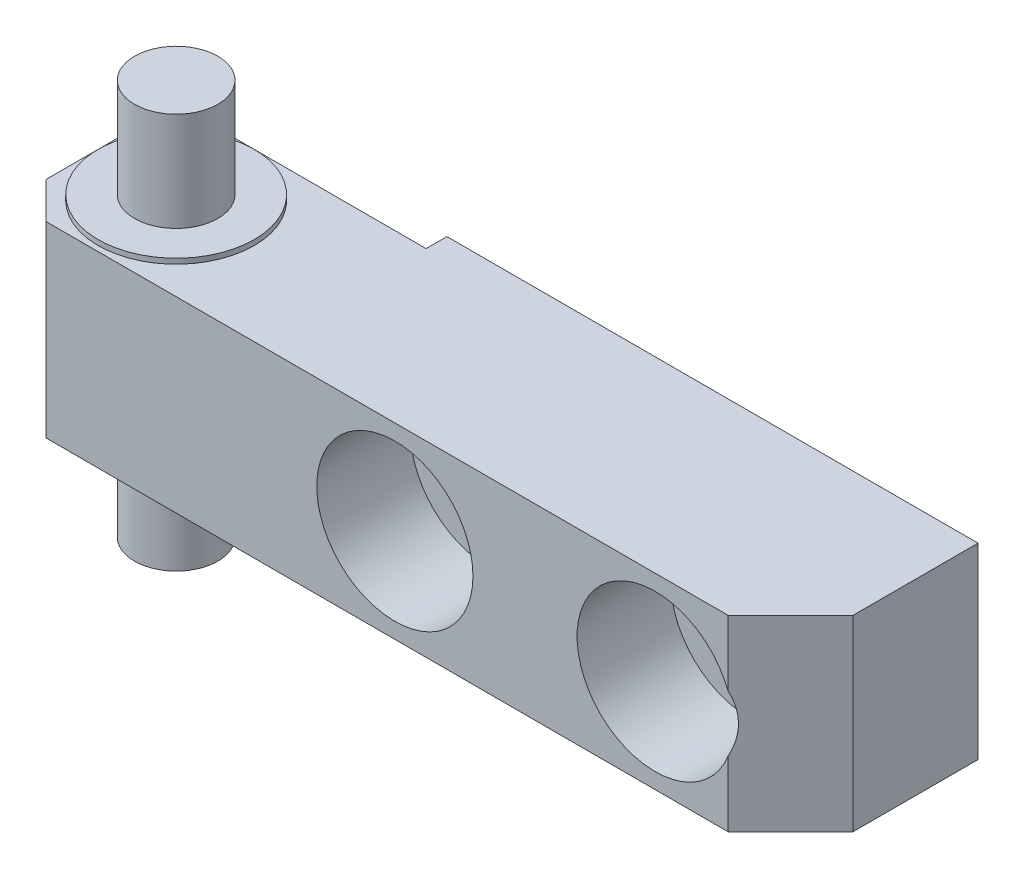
ISO-10303-21;
HEADER;
FILE_DESCRIPTION(('STEP AP214'),'2;1');
FILE_NAME('part.step','',(''),(''),'','','');
FILE_SCHEMA(('AUTOMOTIVE_DESIGN { 1 0 10303 214 1 1 1 1 }'));
ENDSEC;
DATA;
#1=APPLICATION_CONTEXT('core data for automotive mechanical design processes');
#2=APPLICATION_PROTOCOL_DEFINITION('international standard','automotive_design',2000,#1);
#3=PRODUCT_CONTEXT('',#1,'mechanical');
#4=PRODUCT('Part','Part','',(#3));
#5=PRODUCT_RELATED_PRODUCT_CATEGORY('part','',(#4));
#6=PRODUCT_DEFINITION_FORMATION('','',#4);
#7=PRODUCT_DEFINITION_CONTEXT('part definition',#1,'design');
#8=PRODUCT_DEFINITION('design','',#6,#7);
#9=PRODUCT_DEFINITION_SHAPE('','',#8);
#10=(LENGTH_UNIT() NAMED_UNIT(*) SI_UNIT(.MILLI.,.METRE.));
#11=(NAMED_UNIT(*) PLANE_ANGLE_UNIT() SI_UNIT($,.RADIAN.));
#12=(NAMED_UNIT(*) SI_UNIT($,.STERADIAN.) SOLID_ANGLE_UNIT());
#13=UNCERTAINTY_MEASURE_WITH_UNIT(LENGTH_MEASURE(1.E-05),#10,'distance_accuracy_value','');
#14=(GEOMETRIC_REPRESENTATION_CONTEXT(3) GLOBAL_UNCERTAINTY_ASSIGNED_CONTEXT((#13)) GLOBAL_UNIT_ASSIGNED_CONTEXT((#10,
#11,#12)) REPRESENTATION_CONTEXT('',''));
#15=CARTESIAN_POINT('',(0.,0.,0.));
#16=DIRECTION('',(0.,0.,1.));
#17=DIRECTION('',(1.,0.,0.));
#18=AXIS2_PLACEMENT_3D('',#15,#16,#17);
#19=CARTESIAN_POINT('',(-67.,28.,-8.));
#20=DIRECTION('',(0.,-1.,0.));
#21=DIRECTION('',(0.,0.,1.));
#22=AXIS2_PLACEMENT_3D('',#19,#20,#21);
#23=CYLINDRICAL_SURFACE('',#22,4.);
#24=CARTESIAN_POINT('',(-67.,-10.,-8.));
#25=DIRECTION('',(0.,-1.,0.));
#26=DIRECTION('',(0.,0.,1.));
#27=AXIS2_PLACEMENT_3D('',#24,#25,#26);
#28=CIRCLE('',#27,4.);
#29=CARTESIAN_POINT('',(-67.,-10.,-4.));
#30=VERTEX_POINT('',#29);
#31=EDGE_CURVE('E133',#30,#30,#28,.F.);
#32=ORIENTED_EDGE('',*,*,#31,.T.);
#33=EDGE_LOOP('',(#32));
#34=FACE_BOUND('',#33,.T.);
#35=CARTESIAN_POINT('',(-67.,-0.5,-8.));
#36=DIRECTION('',(0.,1.,0.));
#37=DIRECTION('',(0.,0.,1.));
#38=AXIS2_PLACEMENT_3D('',#35,#36,#37);
#39=CIRCLE('',#38,4.);
#40=CARTESIAN_POINT('',(-67.,-0.499999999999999,-4.));
#41=VERTEX_POINT('',#40);
#42=EDGE_CURVE('E130',#41,#41,#39,.T.);
#43=ORIENTED_EDGE('',*,*,#42,.F.);
#44=EDGE_LOOP('',(#43));
#45=FACE_BOUND('',#44,.T.);
#46=ADVANCED_FACE('F14',(#34,#45),#23,.T.);
#47=CARTESIAN_POINT('',(-67.,-10.,-8.));
#48=DIRECTION('',(0.,-1.,0.));
#49=DIRECTION('',(0.,0.,1.));
#50=AXIS2_PLACEMENT_3D('',#47,#48,#49);
#51=PLANE('',#50);
#52=ORIENTED_EDGE('',*,*,#31,.F.);
#53=EDGE_LOOP('',(#52));
#54=FACE_BOUND('',#53,.T.);
#55=ADVANCED_FACE('F16',(#54),#51,.T.);
#56=CARTESIAN_POINT('',(-67.,-0.5,-8.));
#57=DIRECTION('',(0.,1.,0.));
#58=DIRECTION('',(0.,0.,1.));
#59=AXIS2_PLACEMENT_3D('',#56,#57,#58);
#60=PLANE('',#59);
#61=ORIENTED_EDGE('',*,*,#42,.T.);
#62=EDGE_LOOP('',(#61));
#63=FACE_BOUND('',#62,.T.);
#64=CARTESIAN_POINT('',(-67.,-0.5,-8.));
#65=DIRECTION('',(0.,1.,0.));
#66=DIRECTION('',(-1.,0.,0.));
#67=AXIS2_PLACEMENT_3D('',#64,#65,#66);
#68=CIRCLE('',#67,7.5);
#69=CARTESIAN_POINT('',(-74.5,-0.499999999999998,-8.));
#70=VERTEX_POINT('',#69);
#71=EDGE_CURVE('E121',#70,#70,#68,.T.);
#72=ORIENTED_EDGE('',*,*,#71,.F.);
#73=EDGE_LOOP('',(#72));
#74=FACE_BOUND('',#73,.T.);
#75=ADVANCED_FACE('F142',(#63,#74),#60,.F.);
#76=CARTESIAN_POINT('',(-67.,18.5,-8.));
#77=DIRECTION('',(0.,-1.,0.));
#78=DIRECTION('',(1.,0.,0.));
#79=AXIS2_PLACEMENT_3D('',#76,#77,#78);
#80=CYLINDRICAL_SURFACE('',#79,7.5);
#81=CARTESIAN_POINT('',(-67.,18.,-8.));
#82=DIRECTION('',(0.,-1.,0.));
#83=DIRECTION('',(1.,0.,0.));
#84=AXIS2_PLACEMENT_3D('',#81,#82,#83);
#85=CIRCLE('',#84,7.5);
#86=CARTESIAN_POINT('',(-59.5,18.,-8.));
#87=VERTEX_POINT('',#86);
#88=EDGE_CURVE('E124',#87,#87,#85,.F.);
#89=ORIENTED_EDGE('',*,*,#88,.T.);
#90=EDGE_LOOP('',(#89));
#91=FACE_BOUND('',#90,.T.);
#92=CARTESIAN_POINT('',(-67.,18.5,-8.));
#93=DIRECTION('',(0.,-1.,0.));
#94=DIRECTION('',(1.,0.,0.));
#95=AXIS2_PLACEMENT_3D('',#92,#93,#94);
#96=CIRCLE('',#95,7.5);
#97=CARTESIAN_POINT('',(-59.5,18.5,-8.));
#98=VERTEX_POINT('',#97);
#99=EDGE_CURVE('E127',#98,#98,#96,.T.);
#100=ORIENTED_EDGE('',*,*,#99,.T.);
#101=EDGE_LOOP('',(#100));
#102=FACE_BOUND('',#101,.T.);
#103=ADVANCED_FACE('F149',(#91,#102),#80,.T.);
#104=CARTESIAN_POINT('',(0.,0.,-9.));
#105=DIRECTION('',(0.,0.,1.));
#106=DIRECTION('',(1.,0.,0.));
#107=AXIS2_PLACEMENT_3D('',#104,#105,#106);
#108=PLANE('',#107);
#109=CARTESIAN_POINT('',(-13.,9.,-9.));
#110=DIRECTION('',(0.,0.,-1.));
#111=DIRECTION('',(-1.,0.,0.));
#112=AXIS2_PLACEMENT_3D('',#109,#110,#111);
#113=CIRCLE('',#112,4.2);
#114=CARTESIAN_POINT('',(-17.2,9.,-9.));
#115=VERTEX_POINT('',#114);
#116=EDGE_CURVE('E302',#115,#115,#113,.T.);
#117=ORIENTED_EDGE('',*,*,#116,.T.);
#118=EDGE_LOOP('',(#117));
#119=FACE_BOUND('',#118,.T.);
#120=CARTESIAN_POINT('',(-13.,9.,-9.));
#121=DIRECTION('',(0.,0.,1.));
#122=DIRECTION('',(1.,0.,0.));
#123=AXIS2_PLACEMENT_3D('',#120,#121,#122);
#124=CIRCLE('',#123,7.5);
#125=CARTESIAN_POINT('',(-5.5,9.,-9.));
#126=VERTEX_POINT('',#125);
#127=EDGE_CURVE('E379',#126,#126,#124,.T.);
#128=ORIENTED_EDGE('',*,*,#127,.T.);
#129=EDGE_LOOP('',(#128));
#130=FACE_BOUND('',#129,.T.);
#131=ADVANCED_FACE('F176',(#119,#130),#108,.T.);
#132=CARTESIAN_POINT('',(0.,0.,-9.));
#133=DIRECTION('',(0.,0.,1.));
#134=DIRECTION('',(1.,0.,0.));
#135=AXIS2_PLACEMENT_3D('',#132,#133,#134);
#136=PLANE('',#135);
#137=CARTESIAN_POINT('',(-38.,9.,-9.));
#138=DIRECTION('',(0.,0.,1.));
#139=DIRECTION('',(1.,0.,0.));
#140=AXIS2_PLACEMENT_3D('',#137,#138,#139);
#141=CIRCLE('',#140,4.2);
#142=CARTESIAN_POINT('',(-33.8,9.,-9.));
#143=VERTEX_POINT('',#142);
#144=EDGE_CURVE('E376',#143,#143,#141,.F.);
#145=ORIENTED_EDGE('',*,*,#144,.T.);
#146=EDGE_LOOP('',(#145));
#147=FACE_BOUND('',#146,.T.);
#148=CARTESIAN_POINT('',(-38.,9.,-9.));
#149=DIRECTION('',(0.,0.,1.));
#150=DIRECTION('',(1.,0.,0.));
#151=AXIS2_PLACEMENT_3D('',#148,#149,#150);
#152=CIRCLE('',#151,7.5);
#153=CARTESIAN_POINT('',(-30.5,9.,-9.));
#154=VERTEX_POINT('',#153);
#155=EDGE_CURVE('E134',#154,#154,#152,.T.);
#156=ORIENTED_EDGE('',*,*,#155,.T.);
#157=EDGE_LOOP('',(#156));
#158=FACE_BOUND('',#157,.T.);
#159=ADVANCED_FACE('F184',(#147,#158),#136,.T.);
#160=CARTESIAN_POINT('',(-67.,-0.5,-8.));
#161=DIRECTION('',(0.,1.,0.));
#162=DIRECTION('',(-1.,0.,0.));
#163=AXIS2_PLACEMENT_3D('',#160,#161,#162);
#164=CYLINDRICAL_SURFACE('',#163,7.5);
#165=CARTESIAN_POINT('',(-67.,0.,-8.));
#166=DIRECTION('',(0.,1.,0.));
#167=DIRECTION('',(-1.,0.,0.));
#168=AXIS2_PLACEMENT_3D('',#165,#166,#167);
#169=CIRCLE('',#168,7.5);
#170=CARTESIAN_POINT('',(-74.5,0.,-8.));
#171=VERTEX_POINT('',#170);
#172=EDGE_CURVE('E109',#171,#171,#169,.F.);
#173=ORIENTED_EDGE('',*,*,#172,.T.);
#174=EDGE_LOOP('',(#173));
#175=FACE_BOUND('',#174,.T.);
#176=ORIENTED_EDGE('',*,*,#71,.T.);
#177=EDGE_LOOP('',(#176));
#178=FACE_BOUND('',#177,.T.);
#179=ADVANCED_FACE('F179',(#175,#178),#164,.T.);
#180=CARTESIAN_POINT('',(-38.,9.,0.));
#181=DIRECTION('',(0.,0.,1.));
#182=DIRECTION('',(1.,0.,0.));
#183=AXIS2_PLACEMENT_3D('',#180,#181,#182);
#184=CYLINDRICAL_SURFACE('',#183,4.2);
#185=CARTESIAN_POINT('',(-38.,9.,-18.));
#186=DIRECTION('',(0.,0.,1.));
#187=DIRECTION('',(1.,0.,0.));
#188=AXIS2_PLACEMENT_3D('',#185,#186,#187);
#189=CIRCLE('',#188,4.2);
#190=CARTESIAN_POINT('',(-33.8,9.,-18.));
#191=VERTEX_POINT('',#190);
#192=EDGE_CURVE('E278',#191,#191,#189,.T.);
#193=ORIENTED_EDGE('',*,*,#192,.F.);
#194=EDGE_LOOP('',(#193));
#195=FACE_BOUND('',#194,.T.);
#196=ORIENTED_EDGE('',*,*,#144,.F.);
#197=EDGE_LOOP('',(#196));
#198=FACE_BOUND('',#197,.T.);
#199=ADVANCED_FACE('F190',(#195,#198),#184,.F.);
#200=CARTESIAN_POINT('',(-13.,9.,-9.));
#201=DIRECTION('',(0.,0.,-1.));
#202=DIRECTION('',(-1.,0.,0.));
#203=AXIS2_PLACEMENT_3D('',#200,#201,#202);
#204=CYLINDRICAL_SURFACE('',#203,4.2);
#205=ORIENTED_EDGE('',*,*,#116,.F.);
#206=EDGE_LOOP('',(#205));
#207=FACE_BOUND('',#206,.T.);
#208=CARTESIAN_POINT('',(-13.,9.,-18.));
#209=DIRECTION('',(0.,0.,-1.));
#210=DIRECTION('',(-1.,0.,0.));
#211=AXIS2_PLACEMENT_3D('',#208,#209,#210);
#212=CIRCLE('',#211,4.2);
#213=CARTESIAN_POINT('',(-17.2,9.,-18.));
#214=VERTEX_POINT('',#213);
#215=EDGE_CURVE('E282',#214,#214,#212,.F.);
#216=ORIENTED_EDGE('',*,*,#215,.F.);
#217=EDGE_LOOP('',(#216));
#218=FACE_BOUND('',#217,.T.);
#219=ADVANCED_FACE('F197',(#207,#218),#204,.F.);
#220=CARTESIAN_POINT('',(-13.,9.,0.));
#221=DIRECTION('',(0.,0.,1.));
#222=DIRECTION('',(1.,0.,0.));
#223=AXIS2_PLACEMENT_3D('',#220,#221,#222);
#224=CYLINDRICAL_SURFACE('',#223,7.5);
#225=ORIENTED_EDGE('',*,*,#127,.F.);
#226=EDGE_LOOP('',(#225));
#227=FACE_BOUND('',#226,.T.);
#228=CARTESIAN_POINT('',(-13.,9.,0.));
#229=DIRECTION('',(0.,0.,1.));
#230=DIRECTION('',(1.,0.,0.));
#231=AXIS2_PLACEMENT_3D('',#228,#229,#230);
#232=CIRCLE('',#231,7.5);
#233=CARTESIAN_POINT('',(-6.,11.6925824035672,0.));
#234=VERTEX_POINT('',#233);
#235=CARTESIAN_POINT('',(-6.,6.30741759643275,0.));
#236=VERTEX_POINT('',#235);
#237=EDGE_CURVE('E271',#234,#236,#232,.T.);
#238=ORIENTED_EDGE('',*,*,#237,.T.);
#239=CARTESIAN_POINT('',(-13.,9.,7.));
#240=DIRECTION('',(0.707106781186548,0.,0.707106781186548));
#241=DIRECTION('',(-0.707106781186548,0.,0.707106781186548));
#242=AXIS2_PLACEMENT_3D('',#239,#240,#241);
#243=ELLIPSE('',#242,10.6066017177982,7.5);
#244=EDGE_CURVE('E273',#234,#236,#243,.F.);
#245=ORIENTED_EDGE('',*,*,#244,.F.);
#246=EDGE_LOOP('',(#238,#245));
#247=FACE_BOUND('',#246,.T.);
#248=ADVANCED_FACE('F200',(#227,#247),#224,.F.);
#249=CARTESIAN_POINT('',(-38.,9.,0.));
#250=DIRECTION('',(0.,0.,1.));
#251=DIRECTION('',(1.,0.,0.));
#252=AXIS2_PLACEMENT_3D('',#249,#250,#251);
#253=CYLINDRICAL_SURFACE('',#252,7.5);
#254=ORIENTED_EDGE('',*,*,#155,.F.);
#255=EDGE_LOOP('',(#254));
#256=FACE_BOUND('',#255,.T.);
#257=CARTESIAN_POINT('',(-38.,9.,0.));
#258=DIRECTION('',(0.,0.,1.));
#259=DIRECTION('',(1.,0.,0.));
#260=AXIS2_PLACEMENT_3D('',#257,#258,#259);
#261=CIRCLE('',#260,7.5);
#262=CARTESIAN_POINT('',(-30.5,9.,0.));
#263=VERTEX_POINT('',#262);
#264=EDGE_CURVE('E260',#263,#263,#261,.T.);
#265=ORIENTED_EDGE('',*,*,#264,.T.);
#266=EDGE_LOOP('',(#265));
#267=FACE_BOUND('',#266,.T.);
#268=ADVANCED_FACE('F187',(#256,#267),#253,.F.);
#269=CARTESIAN_POINT('',(0.,0.,0.));
#270=DIRECTION('',(0.,-1.,0.));
#271=DIRECTION('',(0.,0.,1.));
#272=AXIS2_PLACEMENT_3D('',#269,#270,#271);
#273=PLANE('',#272);
#274=ORIENTED_EDGE('',*,*,#172,.F.);
#275=EDGE_LOOP('',(#274));
#276=FACE_BOUND('',#275,.T.);
#277=DIRECTION('',(-0.707106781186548,0.,0.707106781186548));
#278=VECTOR('',#277,1.);
#279=CARTESIAN_POINT('',(-75.,0.,-12.5));
#280=LINE('',#279,#278);
#281=CARTESIAN_POINT('',(-71.5,0.,-16.));
#282=VERTEX_POINT('',#281);
#283=CARTESIAN_POINT('',(-75.,0.,-12.5));
#284=VERTEX_POINT('',#283);
#285=EDGE_CURVE('E300',#282,#284,#280,.T.);
#286=ORIENTED_EDGE('',*,*,#285,.F.);
#287=DIRECTION('',(1.,0.,0.));
#288=VECTOR('',#287,1.);
#289=CARTESIAN_POINT('',(-75.,0.,-16.));
#290=LINE('',#289,#288);
#291=CARTESIAN_POINT('',(-51.,0.,-16.));
#292=VERTEX_POINT('',#291);
#293=EDGE_CURVE('E99',#282,#292,#290,.T.);
#294=ORIENTED_EDGE('',*,*,#293,.T.);
#295=DIRECTION('',(0.,0.,-1.));
#296=VECTOR('',#295,1.);
#297=CARTESIAN_POINT('',(-51.,0.,-16.));
#298=LINE('',#297,#296);
#299=CARTESIAN_POINT('',(-51.,0.,-18.));
#300=VERTEX_POINT('',#299);
#301=EDGE_CURVE('E96',#292,#300,#298,.T.);
#302=ORIENTED_EDGE('',*,*,#301,.T.);
#303=DIRECTION('',(-1.,0.,0.));
#304=VECTOR('',#303,1.);
#305=CARTESIAN_POINT('',(0.,0.,-18.));
#306=LINE('',#305,#304);
#307=CARTESIAN_POINT('',(0.,0.,-18.));
#308=VERTEX_POINT('',#307);
#309=EDGE_CURVE('E281',#308,#300,#306,.T.);
#310=ORIENTED_EDGE('',*,*,#309,.F.);
#311=DIRECTION('',(0.,0.,-1.));
#312=VECTOR('',#311,1.);
#313=CARTESIAN_POINT('',(0.,0.,0.));
#314=LINE('',#313,#312);
#315=CARTESIAN_POINT('',(0.,0.,-6.));
#316=VERTEX_POINT('',#315);
#317=EDGE_CURVE('E277',#316,#308,#314,.T.);
#318=ORIENTED_EDGE('',*,*,#317,.F.);
#319=DIRECTION('',(0.707106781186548,0.,-0.707106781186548));
#320=VECTOR('',#319,1.);
#321=CARTESIAN_POINT('',(-6.,0.,0.));
#322=LINE('',#321,#320);
#323=CARTESIAN_POINT('',(-6.,0.,0.));
#324=VERTEX_POINT('',#323);
#325=EDGE_CURVE('E267',#324,#316,#322,.T.);
#326=ORIENTED_EDGE('',*,*,#325,.F.);
#327=DIRECTION('',(-1.,0.,0.));
#328=VECTOR('',#327,1.);
#329=CARTESIAN_POINT('',(0.,0.,0.));
#330=LINE('',#329,#328);
#331=CARTESIAN_POINT('',(-71.5,0.,0.));
#332=VERTEX_POINT('',#331);
#333=EDGE_CURVE('E264',#324,#332,#330,.T.);
#334=ORIENTED_EDGE('',*,*,#333,.T.);
#335=DIRECTION('',(0.707106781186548,0.,0.707106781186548));
#336=VECTOR('',#335,1.);
#337=CARTESIAN_POINT('',(-71.5,0.,0.));
#338=LINE('',#337,#336);
#339=CARTESIAN_POINT('',(-75.,0.,-3.5));
#340=VERTEX_POINT('',#339);
#341=EDGE_CURVE('E321',#340,#332,#338,.T.);
#342=ORIENTED_EDGE('',*,*,#341,.F.);
#343=DIRECTION('',(0.,0.,1.));
#344=VECTOR('',#343,1.);
#345=CARTESIAN_POINT('',(-75.,0.,0.));
#346=LINE('',#345,#344);
#347=EDGE_CURVE('E31',#284,#340,#346,.T.);
#348=ORIENTED_EDGE('',*,*,#347,.F.);
#349=EDGE_LOOP('',(#286,#294,#302,#310,#318,#326,#334,#342,#348));
#350=FACE_BOUND('',#349,.T.);
#351=ADVANCED_FACE('F217',(#276,#350),#273,.T.);
#352=CARTESIAN_POINT('',(0.,0.,-18.));
#353=DIRECTION('',(0.,0.,-1.));
#354=DIRECTION('',(-1.,0.,0.));
#355=AXIS2_PLACEMENT_3D('',#352,#353,#354);
#356=PLANE('',#355);
#357=ORIENTED_EDGE('',*,*,#215,.T.);
#358=EDGE_LOOP('',(#357));
#359=FACE_BOUND('',#358,.T.);
#360=ORIENTED_EDGE('',*,*,#192,.T.);
#361=EDGE_LOOP('',(#360));
#362=FACE_BOUND('',#361,.T.);
#363=ORIENTED_EDGE('',*,*,#309,.T.);
#364=DIRECTION('',(0.,1.,0.));
#365=VECTOR('',#364,1.);
#366=CARTESIAN_POINT('',(-51.,18.,-18.));
#367=LINE('',#366,#365);
#368=CARTESIAN_POINT('',(-51.,18.,-18.));
#369=VERTEX_POINT('',#368);
#370=EDGE_CURVE('E83',#300,#369,#367,.T.);
#371=ORIENTED_EDGE('',*,*,#370,.T.);
#372=DIRECTION('',(-1.,0.,0.));
#373=VECTOR('',#372,1.);
#374=CARTESIAN_POINT('',(-75.,18.,-18.));
#375=LINE('',#374,#373);
#376=CARTESIAN_POINT('',(0.,18.,-18.));
#377=VERTEX_POINT('',#376);
#378=EDGE_CURVE('E113',#377,#369,#375,.T.);
#379=ORIENTED_EDGE('',*,*,#378,.F.);
#380=DIRECTION('',(0.,1.,0.));
#381=VECTOR('',#380,1.);
#382=CARTESIAN_POINT('',(0.,0.,-18.));
#383=LINE('',#382,#381);
#384=EDGE_CURVE('E354',#377,#308,#383,.F.);
#385=ORIENTED_EDGE('',*,*,#384,.T.);
#386=EDGE_LOOP('',(#363,#371,#379,#385));
#387=FACE_BOUND('',#386,.T.);
#388=ADVANCED_FACE('F213',(#359,#362,#387),#356,.T.);
#389=CARTESIAN_POINT('',(0.,18.,0.));
#390=DIRECTION('',(1.,0.,0.));
#391=DIRECTION('',(0.,0.,-1.));
#392=AXIS2_PLACEMENT_3D('',#389,#390,#391);
#393=PLANE('',#392);
#394=DIRECTION('',(0.,0.,-1.));
#395=VECTOR('',#394,1.);
#396=CARTESIAN_POINT('',(0.,18.,0.));
#397=LINE('',#396,#395);
#398=CARTESIAN_POINT('',(0.,18.,-6.));
#399=VERTEX_POINT('',#398);
#400=EDGE_CURVE('E115',#399,#377,#397,.T.);
#401=ORIENTED_EDGE('',*,*,#400,.F.);
#402=DIRECTION('',(0.,1.,0.));
#403=VECTOR('',#402,1.);
#404=CARTESIAN_POINT('',(0.,18.,-6.));
#405=LINE('',#404,#403);
#406=EDGE_CURVE('E351',#399,#316,#405,.F.);
#407=ORIENTED_EDGE('',*,*,#406,.T.);
#408=ORIENTED_EDGE('',*,*,#317,.T.);
#409=ORIENTED_EDGE('',*,*,#384,.F.);
#410=EDGE_LOOP('',(#401,#407,#408,#409));
#411=FACE_BOUND('',#410,.T.);
#412=ADVANCED_FACE('F216',(#411),#393,.T.);
#413=CARTESIAN_POINT('',(-6.,18.,0.));
#414=DIRECTION('',(0.707106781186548,0.,0.707106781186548));
#415=DIRECTION('',(0.707106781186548,0.,-0.707106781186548));
#416=AXIS2_PLACEMENT_3D('',#413,#414,#415);
#417=PLANE('',#416);
#418=DIRECTION('',(0.,1.,0.));
#419=VECTOR('',#418,1.);
#420=CARTESIAN_POINT('',(-6.,18.,0.));
#421=LINE('',#420,#419);
#422=CARTESIAN_POINT('',(-6.,18.,0.));
#423=VERTEX_POINT('',#422);
#424=EDGE_CURVE('E276',#423,#234,#421,.F.);
#425=ORIENTED_EDGE('',*,*,#424,.T.);
#426=ORIENTED_EDGE('',*,*,#244,.T.);
#427=DIRECTION('',(0.,1.,0.));
#428=VECTOR('',#427,1.);
#429=CARTESIAN_POINT('',(-6.,18.,0.));
#430=LINE('',#429,#428);
#431=EDGE_CURVE('E262',#236,#324,#430,.F.);
#432=ORIENTED_EDGE('',*,*,#431,.T.);
#433=ORIENTED_EDGE('',*,*,#325,.T.);
#434=ORIENTED_EDGE('',*,*,#406,.F.);
#435=DIRECTION('',(0.707106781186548,0.,-0.707106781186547));
#436=VECTOR('',#435,1.);
#437=CARTESIAN_POINT('',(-6.,18.,0.));
#438=LINE('',#437,#436);
#439=EDGE_CURVE('E339',#423,#399,#438,.T.);
#440=ORIENTED_EDGE('',*,*,#439,.F.);
#441=EDGE_LOOP('',(#425,#426,#432,#433,#434,#440));
#442=FACE_BOUND('',#441,.T.);
#443=ADVANCED_FACE('F221',(#442),#417,.T.);
#444=CARTESIAN_POINT('',(0.,0.,0.));
#445=DIRECTION('',(0.,0.,-1.));
#446=DIRECTION('',(-1.,0.,0.));
#447=AXIS2_PLACEMENT_3D('',#444,#445,#446);
#448=PLANE('',#447);
#449=ORIENTED_EDGE('',*,*,#264,.F.);
#450=EDGE_LOOP('',(#449));
#451=FACE_BOUND('',#450,.T.);
#452=DIRECTION('',(-1.,0.,0.));
#453=VECTOR('',#452,1.);
#454=CARTESIAN_POINT('',(-75.,18.,0.));
#455=LINE('',#454,#453);
#456=CARTESIAN_POINT('',(-71.5,18.,0.));
#457=VERTEX_POINT('',#456);
#458=EDGE_CURVE('E313',#457,#423,#455,.F.);
#459=ORIENTED_EDGE('',*,*,#458,.F.);
#460=DIRECTION('',(0.,1.,0.));
#461=VECTOR('',#460,1.);
#462=CARTESIAN_POINT('',(-71.5,0.,0.));
#463=LINE('',#462,#461);
#464=EDGE_CURVE('E261',#332,#457,#463,.T.);
#465=ORIENTED_EDGE('',*,*,#464,.F.);
#466=ORIENTED_EDGE('',*,*,#333,.F.);
#467=ORIENTED_EDGE('',*,*,#431,.F.);
#468=ORIENTED_EDGE('',*,*,#237,.F.);
#469=ORIENTED_EDGE('',*,*,#424,.F.);
#470=EDGE_LOOP('',(#459,#465,#466,#467,#468,#469));
#471=FACE_BOUND('',#470,.T.);
#472=ADVANCED_FACE('F225',(#451,#471),#448,.F.);
#473=CARTESIAN_POINT('',(-71.5,0.,0.));
#474=DIRECTION('',(-0.707106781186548,0.,0.707106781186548));
#475=DIRECTION('',(0.707106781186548,0.,0.707106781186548));
#476=AXIS2_PLACEMENT_3D('',#473,#474,#475);
#477=PLANE('',#476);
#478=ORIENTED_EDGE('',*,*,#341,.T.);
#479=ORIENTED_EDGE('',*,*,#464,.T.);
#480=DIRECTION('',(0.707106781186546,0.,0.707106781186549));
#481=VECTOR('',#480,1.);
#482=CARTESIAN_POINT('',(-75.,18.,-3.5));
#483=LINE('',#482,#481);
#484=CARTESIAN_POINT('',(-75.,18.,-3.5));
#485=VERTEX_POINT('',#484);
#486=EDGE_CURVE('E308',#485,#457,#483,.T.);
#487=ORIENTED_EDGE('',*,*,#486,.F.);
#488=DIRECTION('',(0.,1.,0.));
#489=VECTOR('',#488,1.);
#490=CARTESIAN_POINT('',(-75.,0.,-3.5));
#491=LINE('',#490,#489);
#492=EDGE_CURVE('E297',#485,#340,#491,.F.);
#493=ORIENTED_EDGE('',*,*,#492,.T.);
#494=EDGE_LOOP('',(#478,#479,#487,#493));
#495=FACE_BOUND('',#494,.T.);
#496=ADVANCED_FACE('F229',(#495),#477,.T.);
#497=CARTESIAN_POINT('',(-75.,0.,0.));
#498=DIRECTION('',(-1.,0.,0.));
#499=DIRECTION('',(0.,0.,1.));
#500=AXIS2_PLACEMENT_3D('',#497,#498,#499);
#501=PLANE('',#500);
#502=DIRECTION('',(0.,0.,-1.));
#503=VECTOR('',#502,1.);
#504=CARTESIAN_POINT('',(-75.,18.,0.));
#505=LINE('',#504,#503);
#506=CARTESIAN_POINT('',(-75.,18.,-12.5));
#507=VERTEX_POINT('',#506);
#508=EDGE_CURVE('E305',#507,#485,#505,.F.);
#509=ORIENTED_EDGE('',*,*,#508,.F.);
#510=DIRECTION('',(0.,1.,0.));
#511=VECTOR('',#510,1.);
#512=CARTESIAN_POINT('',(-75.,0.,-12.5));
#513=LINE('',#512,#511);
#514=EDGE_CURVE('E294',#507,#284,#513,.F.);
#515=ORIENTED_EDGE('',*,*,#514,.T.);
#516=ORIENTED_EDGE('',*,*,#347,.T.);
#517=ORIENTED_EDGE('',*,*,#492,.F.);
#518=EDGE_LOOP('',(#509,#515,#516,#517));
#519=FACE_BOUND('',#518,.T.);
#520=ADVANCED_FACE('F233',(#519),#501,.T.);
#521=CARTESIAN_POINT('',(-75.,0.,-12.5));
#522=DIRECTION('',(-0.707106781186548,0.,-0.707106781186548));
#523=DIRECTION('',(-0.707106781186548,0.,0.707106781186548));
#524=AXIS2_PLACEMENT_3D('',#521,#522,#523);
#525=PLANE('',#524);
#526=ORIENTED_EDGE('',*,*,#285,.T.);
#527=ORIENTED_EDGE('',*,*,#514,.F.);
#528=DIRECTION('',(-0.707106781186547,0.,0.707106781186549));
#529=VECTOR('',#528,1.);
#530=CARTESIAN_POINT('',(-71.5,18.,-16.));
#531=LINE('',#530,#529);
#532=CARTESIAN_POINT('',(-71.5,18.,-16.));
#533=VERTEX_POINT('',#532);
#534=EDGE_CURVE('E291',#533,#507,#531,.T.);
#535=ORIENTED_EDGE('',*,*,#534,.F.);
#536=DIRECTION('',(0.,1.,0.));
#537=VECTOR('',#536,1.);
#538=CARTESIAN_POINT('',(-71.5,18.,-16.));
#539=LINE('',#538,#537);
#540=EDGE_CURVE('E100',#533,#282,#539,.F.);
#541=ORIENTED_EDGE('',*,*,#540,.T.);
#542=EDGE_LOOP('',(#526,#527,#535,#541));
#543=FACE_BOUND('',#542,.T.);
#544=ADVANCED_FACE('F210',(#543),#525,.T.);
#545=CARTESIAN_POINT('',(-75.,18.,-16.));
#546=DIRECTION('',(0.,0.,1.));
#547=DIRECTION('',(1.,0.,0.));
#548=AXIS2_PLACEMENT_3D('',#545,#546,#547);
#549=PLANE('',#548);
#550=DIRECTION('',(-1.,0.,0.));
#551=VECTOR('',#550,1.);
#552=CARTESIAN_POINT('',(-75.,18.,-16.));
#553=LINE('',#552,#551);
#554=CARTESIAN_POINT('',(-51.,18.,-16.));
#555=VERTEX_POINT('',#554);
#556=EDGE_CURVE('E104',#555,#533,#553,.T.);
#557=ORIENTED_EDGE('',*,*,#556,.F.);
#558=DIRECTION('',(0.,1.,0.));
#559=VECTOR('',#558,1.);
#560=CARTESIAN_POINT('',(-51.,18.,-16.));
#561=LINE('',#560,#559);
#562=EDGE_CURVE('E89',#292,#555,#561,.T.);
#563=ORIENTED_EDGE('',*,*,#562,.F.);
#564=ORIENTED_EDGE('',*,*,#293,.F.);
#565=ORIENTED_EDGE('',*,*,#540,.F.);
#566=EDGE_LOOP('',(#557,#563,#564,#565));
#567=FACE_BOUND('',#566,.T.);
#568=ADVANCED_FACE('F105',(#567),#549,.F.);
#569=CARTESIAN_POINT('',(-51.,18.,-16.));
#570=DIRECTION('',(1.,0.,0.));
#571=DIRECTION('',(0.,0.,-1.));
#572=AXIS2_PLACEMENT_3D('',#569,#570,#571);
#573=PLANE('',#572);
#574=ORIENTED_EDGE('',*,*,#562,.T.);
#575=DIRECTION('',(0.,0.,-1.));
#576=VECTOR('',#575,1.);
#577=CARTESIAN_POINT('',(-51.,18.,0.));
#578=LINE('',#577,#576);
#579=EDGE_CURVE('E93',#369,#555,#578,.F.);
#580=ORIENTED_EDGE('',*,*,#579,.F.);
#581=ORIENTED_EDGE('',*,*,#370,.F.);
#582=ORIENTED_EDGE('',*,*,#301,.F.);
#583=EDGE_LOOP('',(#574,#580,#581,#582));
#584=FACE_BOUND('',#583,.T.);
#585=ADVANCED_FACE('F91',(#584),#573,.F.);
#586=CARTESIAN_POINT('',(-75.,18.,0.));
#587=DIRECTION('',(0.,1.,0.));
#588=DIRECTION('',(0.,0.,-1.));
#589=AXIS2_PLACEMENT_3D('',#586,#587,#588);
#590=PLANE('',#589);
#591=ORIENTED_EDGE('',*,*,#88,.F.);
#592=EDGE_LOOP('',(#591));
#593=FACE_BOUND('',#592,.T.);
#594=ORIENTED_EDGE('',*,*,#579,.T.);
#595=ORIENTED_EDGE('',*,*,#556,.T.);
#596=ORIENTED_EDGE('',*,*,#534,.T.);
#597=ORIENTED_EDGE('',*,*,#508,.T.);
#598=ORIENTED_EDGE('',*,*,#486,.T.);
#599=ORIENTED_EDGE('',*,*,#458,.T.);
#600=ORIENTED_EDGE('',*,*,#439,.T.);
#601=ORIENTED_EDGE('',*,*,#400,.T.);
#602=ORIENTED_EDGE('',*,*,#378,.T.);
#603=EDGE_LOOP('',(#594,#595,#596,#597,#598,#599,#600,#601,#602));
#604=FACE_BOUND('',#603,.T.);
#605=ADVANCED_FACE('F111',(#593,#604),#590,.T.);
#606=CARTESIAN_POINT('',(-67.,28.,-8.));
#607=DIRECTION('',(0.,-1.,0.));
#608=DIRECTION('',(0.,0.,1.));
#609=AXIS2_PLACEMENT_3D('',#606,#607,#608);
#610=PLANE('',#609);
#611=CARTESIAN_POINT('',(-67.,28.,-8.));
#612=DIRECTION('',(0.,-1.,0.));
#613=DIRECTION('',(0.,0.,1.));
#614=AXIS2_PLACEMENT_3D('',#611,#612,#613);
#615=CIRCLE('',#614,4.);
#616=CARTESIAN_POINT('',(-67.,28.,-4.));
#617=VERTEX_POINT('',#616);
#618=EDGE_CURVE('E23',#617,#617,#615,.T.);
#619=ORIENTED_EDGE('',*,*,#618,.F.);
#620=EDGE_LOOP('',(#619));
#621=FACE_BOUND('',#620,.T.);
#622=ADVANCED_FACE('F160',(#621),#610,.F.);
#623=CARTESIAN_POINT('',(-67.,18.5,-8.));
#624=DIRECTION('',(0.,1.,0.));
#625=DIRECTION('',(0.,0.,1.));
#626=AXIS2_PLACEMENT_3D('',#623,#624,#625);
#627=CIRCLE('',#626,4.);
#628=CARTESIAN_POINT('',(-67.,18.5,-4.));
#629=VERTEX_POINT('',#628);
#630=EDGE_CURVE('E9',#629,#629,#627,.F.);
#631=ORIENTED_EDGE('',*,*,#630,.F.);
#632=EDGE_LOOP('',(#631));
#633=FACE_BOUND('',#632,.T.);
#634=ORIENTED_EDGE('',*,*,#618,.T.);
#635=EDGE_LOOP('',(#634));
#636=FACE_BOUND('',#635,.T.);
#637=ADVANCED_FACE('F153',(#633,#636),#23,.T.);
#638=CARTESIAN_POINT('',(-67.,18.5,-8.));
#639=DIRECTION('',(0.,1.,0.));
#640=DIRECTION('',(0.,0.,1.));
#641=AXIS2_PLACEMENT_3D('',#638,#639,#640);
#642=PLANE('',#641);
#643=ORIENTED_EDGE('',*,*,#630,.T.);
#644=EDGE_LOOP('',(#643));
#645=FACE_BOUND('',#644,.T.);
#646=ORIENTED_EDGE('',*,*,#99,.F.);
#647=EDGE_LOOP('',(#646));
#648=FACE_BOUND('',#647,.T.);
#649=ADVANCED_FACE('F159',(#645,#648),#642,.T.);
#650=CLOSED_SHELL('',(#46,#55,#75,#103,#131,#159,#179,#199,#219,#248,#268,#351,#388,#412,#443,
#472,#496,#520,#544,#568,#585,#605,#622,#637,#649));
#651=MANIFOLD_SOLID_BREP('B1',#650);
#652=ADVANCED_BREP_SHAPE_REPRESENTATION('',(#18,#651),#14);
#653=SHAPE_DEFINITION_REPRESENTATION(#9,#652);
ENDSEC;
END-ISO-10303-21;
